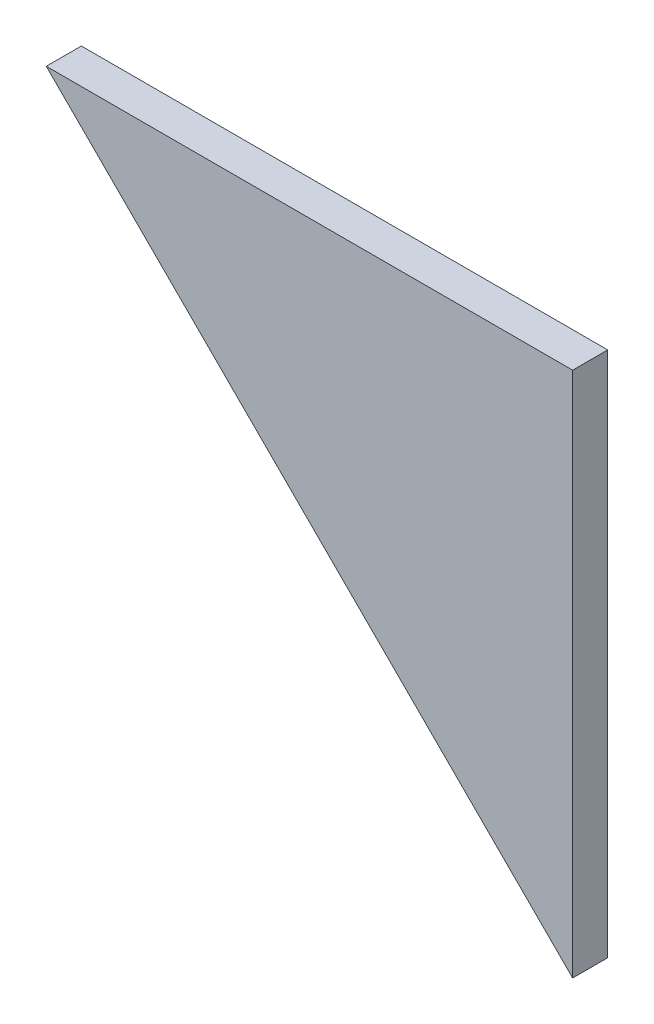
ISO-10303-21;
HEADER;
FILE_DESCRIPTION(('STEP AP214'),'2;1');
FILE_NAME('part.step','',(''),(''),'','','');
FILE_SCHEMA(('AUTOMOTIVE_DESIGN { 1 0 10303 214 1 1 1 1 }'));
ENDSEC;
DATA;
#1=APPLICATION_CONTEXT('core data for automotive mechanical design processes');
#2=APPLICATION_PROTOCOL_DEFINITION('international standard','automotive_design',2000,#1);
#3=PRODUCT_CONTEXT('',#1,'mechanical');
#4=PRODUCT('Part','Part','',(#3));
#5=PRODUCT_RELATED_PRODUCT_CATEGORY('part','',(#4));
#6=PRODUCT_DEFINITION_FORMATION('','',#4);
#7=PRODUCT_DEFINITION_CONTEXT('part definition',#1,'design');
#8=PRODUCT_DEFINITION('design','',#6,#7);
#9=PRODUCT_DEFINITION_SHAPE('','',#8);
#10=(LENGTH_UNIT() NAMED_UNIT(*) SI_UNIT(.MILLI.,.METRE.));
#11=(NAMED_UNIT(*) PLANE_ANGLE_UNIT() SI_UNIT($,.RADIAN.));
#12=(NAMED_UNIT(*) SI_UNIT($,.STERADIAN.) SOLID_ANGLE_UNIT());
#13=UNCERTAINTY_MEASURE_WITH_UNIT(LENGTH_MEASURE(1.E-05),#10,'distance_accuracy_value','');
#14=(GEOMETRIC_REPRESENTATION_CONTEXT(3) GLOBAL_UNCERTAINTY_ASSIGNED_CONTEXT((#13)) GLOBAL_UNIT_ASSIGNED_CONTEXT((#10,
#11,#12)) REPRESENTATION_CONTEXT('',''));
#15=CARTESIAN_POINT('',(0.,0.,0.));
#16=DIRECTION('',(0.,0.,1.));
#17=DIRECTION('',(1.,0.,0.));
#18=AXIS2_PLACEMENT_3D('',#15,#16,#17);
#19=CARTESIAN_POINT('',(150.,-150.,10.));
#20=DIRECTION('',(0.707106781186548,0.707106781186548,0.));
#21=DIRECTION('',(-0.707106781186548,0.707106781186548,0.));
#22=AXIS2_PLACEMENT_3D('',#19,#20,#21);
#23=PLANE('',#22);
#24=DIRECTION('',(0.707106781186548,-0.707106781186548,0.));
#25=VECTOR('',#24,1.);
#26=CARTESIAN_POINT('',(150.,-150.,0.));
#27=LINE('',#26,#25);
#28=CARTESIAN_POINT('',(0.,0.,0.));
#29=VERTEX_POINT('',#28);
#30=CARTESIAN_POINT('',(150.,-150.,0.));
#31=VERTEX_POINT('',#30);
#32=EDGE_CURVE('E82',#29,#31,#27,.T.);
#33=ORIENTED_EDGE('',*,*,#32,.T.);
#34=DIRECTION('',(0.,0.,-1.));
#35=VECTOR('',#34,1.);
#36=CARTESIAN_POINT('',(150.,-150.,10.));
#37=LINE('',#36,#35);
#38=CARTESIAN_POINT('',(150.,-150.,10.));
#39=VERTEX_POINT('',#38);
#40=EDGE_CURVE('E11',#39,#31,#37,.T.);
#41=ORIENTED_EDGE('',*,*,#40,.F.);
#42=DIRECTION('',(0.707106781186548,-0.707106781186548,0.));
#43=VECTOR('',#42,1.);
#44=CARTESIAN_POINT('',(150.,-150.,10.));
#45=LINE('',#44,#43);
#46=CARTESIAN_POINT('',(0.,0.,10.));
#47=VERTEX_POINT('',#46);
#48=EDGE_CURVE('E75',#47,#39,#45,.T.);
#49=ORIENTED_EDGE('',*,*,#48,.F.);
#50=DIRECTION('',(0.,0.,-1.));
#51=VECTOR('',#50,1.);
#52=CARTESIAN_POINT('',(0.,0.,10.));
#53=LINE('',#52,#51);
#54=EDGE_CURVE('E83',#47,#29,#53,.T.);
#55=ORIENTED_EDGE('',*,*,#54,.T.);
#56=EDGE_LOOP('',(#33,#41,#49,#55));
#57=FACE_BOUND('',#56,.T.);
#58=ADVANCED_FACE('F35',(#57),#23,.F.);
#59=CARTESIAN_POINT('',(150.,0.,10.));
#60=DIRECTION('',(-1.,0.,0.));
#61=DIRECTION('',(0.,0.,1.));
#62=AXIS2_PLACEMENT_3D('',#59,#60,#61);
#63=PLANE('',#62);
#64=DIRECTION('',(0.,1.,0.));
#65=VECTOR('',#64,1.);
#66=CARTESIAN_POINT('',(150.,0.,0.));
#67=LINE('',#66,#65);
#68=CARTESIAN_POINT('',(150.,0.,0.));
#69=VERTEX_POINT('',#68);
#70=EDGE_CURVE('E63',#31,#69,#67,.T.);
#71=ORIENTED_EDGE('',*,*,#70,.T.);
#72=DIRECTION('',(0.,0.,-1.));
#73=VECTOR('',#72,1.);
#74=CARTESIAN_POINT('',(150.,0.,10.));
#75=LINE('',#74,#73);
#76=CARTESIAN_POINT('',(150.,0.,10.));
#77=VERTEX_POINT('',#76);
#78=EDGE_CURVE('E43',#77,#69,#75,.T.);
#79=ORIENTED_EDGE('',*,*,#78,.F.);
#80=DIRECTION('',(0.,1.,0.));
#81=VECTOR('',#80,1.);
#82=CARTESIAN_POINT('',(150.,0.,10.));
#83=LINE('',#82,#81);
#84=EDGE_CURVE('E71',#39,#77,#83,.T.);
#85=ORIENTED_EDGE('',*,*,#84,.F.);
#86=ORIENTED_EDGE('',*,*,#40,.T.);
#87=EDGE_LOOP('',(#71,#79,#85,#86));
#88=FACE_BOUND('',#87,.T.);
#89=ADVANCED_FACE('F72',(#88),#63,.F.);
#90=CARTESIAN_POINT('',(0.,0.,10.));
#91=DIRECTION('',(0.,-1.,0.));
#92=DIRECTION('',(0.,0.,-1.));
#93=AXIS2_PLACEMENT_3D('',#90,#91,#92);
#94=PLANE('',#93);
#95=DIRECTION('',(-1.,0.,0.));
#96=VECTOR('',#95,1.);
#97=CARTESIAN_POINT('',(0.,0.,0.));
#98=LINE('',#97,#96);
#99=EDGE_CURVE('E68',#69,#29,#98,.T.);
#100=ORIENTED_EDGE('',*,*,#99,.T.);
#101=ORIENTED_EDGE('',*,*,#54,.F.);
#102=DIRECTION('',(-1.,0.,0.));
#103=VECTOR('',#102,1.);
#104=CARTESIAN_POINT('',(0.,0.,10.));
#105=LINE('',#104,#103);
#106=EDGE_CURVE('E51',#77,#47,#105,.T.);
#107=ORIENTED_EDGE('',*,*,#106,.F.);
#108=ORIENTED_EDGE('',*,*,#78,.T.);
#109=EDGE_LOOP('',(#100,#101,#107,#108));
#110=FACE_BOUND('',#109,.T.);
#111=ADVANCED_FACE('F90',(#110),#94,.F.);
#112=CARTESIAN_POINT('',(0.,0.,10.));
#113=DIRECTION('',(0.,0.,-1.));
#114=DIRECTION('',(-1.,0.,0.));
#115=AXIS2_PLACEMENT_3D('',#112,#113,#114);
#116=PLANE('',#115);
#117=ORIENTED_EDGE('',*,*,#48,.T.);
#118=ORIENTED_EDGE('',*,*,#84,.T.);
#119=ORIENTED_EDGE('',*,*,#106,.T.);
#120=EDGE_LOOP('',(#117,#118,#119));
#121=FACE_BOUND('',#120,.T.);
#122=ADVANCED_FACE('F78',(#121),#116,.F.);
#123=CARTESIAN_POINT('',(0.,0.,0.));
#124=DIRECTION('',(0.,0.,-1.));
#125=DIRECTION('',(-1.,0.,0.));
#126=AXIS2_PLACEMENT_3D('',#123,#124,#125);
#127=PLANE('',#126);
#128=ORIENTED_EDGE('',*,*,#32,.F.);
#129=ORIENTED_EDGE('',*,*,#99,.F.);
#130=ORIENTED_EDGE('',*,*,#70,.F.);
#131=EDGE_LOOP('',(#128,#129,#130));
#132=FACE_BOUND('',#131,.T.);
#133=ADVANCED_FACE('F91',(#132),#127,.T.);
#134=CLOSED_SHELL('',(#58,#89,#111,#122,#133));
#135=MANIFOLD_SOLID_BREP('B2',#134);
#136=ADVANCED_BREP_SHAPE_REPRESENTATION('',(#18,#135),#14);
#137=SHAPE_DEFINITION_REPRESENTATION(#9,#136);
ENDSEC;
END-ISO-10303-21;
